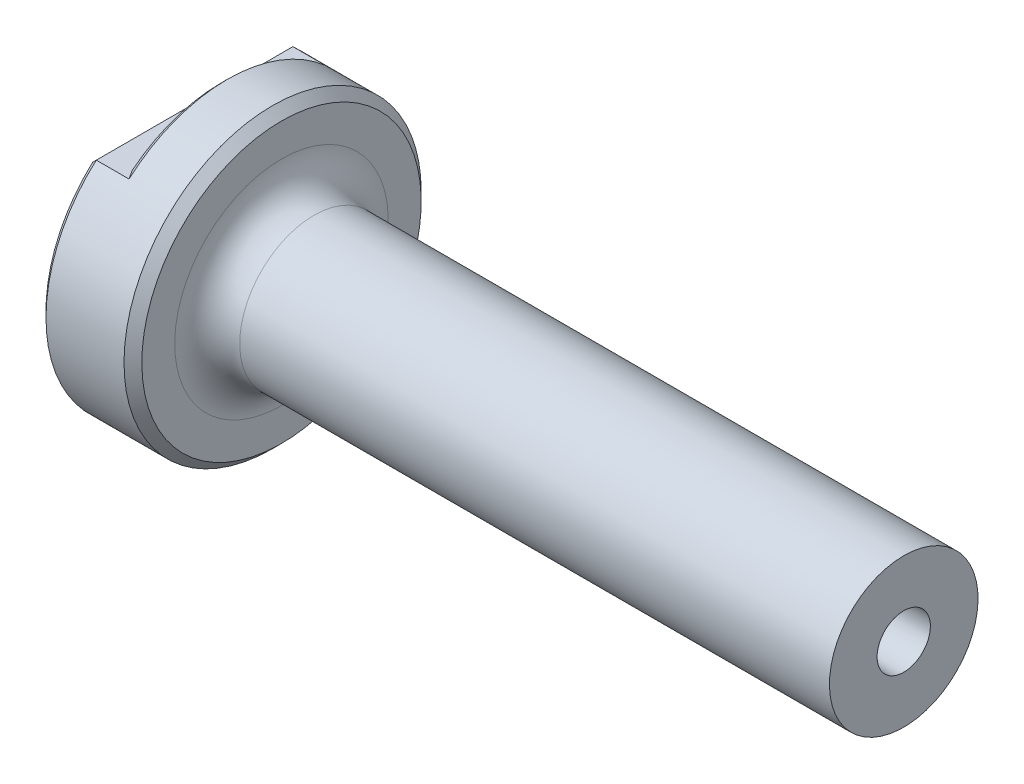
ISO-10303-21;
HEADER;
FILE_DESCRIPTION(('STEP AP214'),'2;1');
FILE_NAME('part.step','',(''),(''),'','','');
FILE_SCHEMA(('AUTOMOTIVE_DESIGN { 1 0 10303 214 1 1 1 1 }'));
ENDSEC;
DATA;
#1=APPLICATION_CONTEXT('core data for automotive mechanical design processes');
#2=APPLICATION_PROTOCOL_DEFINITION('international standard','automotive_design',2000,#1);
#3=PRODUCT_CONTEXT('',#1,'mechanical');
#4=PRODUCT('Part','Part','',(#3));
#5=PRODUCT_RELATED_PRODUCT_CATEGORY('part','',(#4));
#6=PRODUCT_DEFINITION_FORMATION('','',#4);
#7=PRODUCT_DEFINITION_CONTEXT('part definition',#1,'design');
#8=PRODUCT_DEFINITION('design','',#6,#7);
#9=PRODUCT_DEFINITION_SHAPE('','',#8);
#10=(LENGTH_UNIT() NAMED_UNIT(*) SI_UNIT(.MILLI.,.METRE.));
#11=(NAMED_UNIT(*) PLANE_ANGLE_UNIT() SI_UNIT($,.RADIAN.));
#12=(NAMED_UNIT(*) SI_UNIT($,.STERADIAN.) SOLID_ANGLE_UNIT());
#13=UNCERTAINTY_MEASURE_WITH_UNIT(LENGTH_MEASURE(1.E-05),#10,'distance_accuracy_value','');
#14=(GEOMETRIC_REPRESENTATION_CONTEXT(3) GLOBAL_UNCERTAINTY_ASSIGNED_CONTEXT((#13)) GLOBAL_UNIT_ASSIGNED_CONTEXT((#10,
#11,#12)) REPRESENTATION_CONTEXT('',''));
#15=CARTESIAN_POINT('',(0.,0.,0.));
#16=DIRECTION('',(0.,0.,1.));
#17=DIRECTION('',(1.,0.,0.));
#18=AXIS2_PLACEMENT_3D('',#15,#16,#17);
#19=CARTESIAN_POINT('',(61.11875,0.,0.));
#20=DIRECTION('',(1.,0.,0.));
#21=DIRECTION('',(0.,0.,-1.));
#22=AXIS2_PLACEMENT_3D('',#19,#20,#21);
#23=PLANE('',#22);
#24=CARTESIAN_POINT('',(61.11875,0.,0.));
#25=DIRECTION('',(1.,0.,0.));
#26=DIRECTION('',(0.,1.,0.));
#27=AXIS2_PLACEMENT_3D('',#24,#25,#26);
#28=CIRCLE('',#27,12.7);
#29=CARTESIAN_POINT('',(61.11875,12.7,0.));
#30=VERTEX_POINT('',#29);
#31=EDGE_CURVE('E101',#30,#30,#28,.T.);
#32=ORIENTED_EDGE('',*,*,#31,.T.);
#33=EDGE_LOOP('',(#32));
#34=FACE_BOUND('',#33,.T.);
#35=CARTESIAN_POINT('',(61.11875,0.,0.));
#36=DIRECTION('',(1.,0.,0.));
#37=DIRECTION('',(0.,1.,0.));
#38=AXIS2_PLACEMENT_3D('',#35,#36,#37);
#39=CIRCLE('',#38,4.55414053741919);
#40=CARTESIAN_POINT('',(61.11875,4.55414053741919,0.));
#41=VERTEX_POINT('',#40);
#42=EDGE_CURVE('E157',#41,#41,#39,.T.);
#43=ORIENTED_EDGE('',*,*,#42,.F.);
#44=EDGE_LOOP('',(#43));
#45=FACE_BOUND('',#44,.T.);
#46=ADVANCED_FACE('F32',(#34,#45),#23,.T.);
#47=CARTESIAN_POINT('',(-61.11875,0.,0.));
#48=DIRECTION('',(1.,0.,0.));
#49=DIRECTION('',(0.,0.,-1.));
#50=AXIS2_PLACEMENT_3D('',#47,#48,#49);
#51=PLANE('',#50);
#52=CARTESIAN_POINT('',(-61.11875,0.,0.));
#53=DIRECTION('',(1.,0.,0.));
#54=DIRECTION('',(0.,0.,-1.));
#55=AXIS2_PLACEMENT_3D('',#52,#53,#54);
#56=CIRCLE('',#55,24.384);
#57=CARTESIAN_POINT('',(-61.11875,18.034,-16.4120169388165));
#58=VERTEX_POINT('',#57);
#59=CARTESIAN_POINT('',(-61.11875,18.034,16.4120169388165));
#60=VERTEX_POINT('',#59);
#61=EDGE_CURVE('E52',#58,#60,#56,.F.);
#62=ORIENTED_EDGE('',*,*,#61,.T.);
#63=DIRECTION('',(0.,0.,-1.));
#64=VECTOR('',#63,1.);
#65=CARTESIAN_POINT('',(-61.11875,18.034,0.));
#66=LINE('',#65,#64);
#67=EDGE_CURVE('E126',#60,#58,#66,.T.);
#68=ORIENTED_EDGE('',*,*,#67,.T.);
#69=EDGE_LOOP('',(#62,#68));
#70=FACE_BOUND('',#69,.T.);
#71=CARTESIAN_POINT('',(-61.11875,0.,0.));
#72=DIRECTION('',(1.,0.,0.));
#73=DIRECTION('',(0.,1.,0.));
#74=AXIS2_PLACEMENT_3D('',#71,#72,#73);
#75=CIRCLE('',#74,9.80045101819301);
#76=CARTESIAN_POINT('',(-61.11875,9.800451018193,0.));
#77=VERTEX_POINT('',#76);
#78=EDGE_CURVE('E106',#77,#77,#75,.T.);
#79=ORIENTED_EDGE('',*,*,#78,.T.);
#80=EDGE_LOOP('',(#79));
#81=FACE_BOUND('',#80,.T.);
#82=ADVANCED_FACE('F166',(#70,#81),#51,.F.);
#83=CARTESIAN_POINT('',(61.11875,0.,0.));
#84=DIRECTION('',(-1.,0.,0.));
#85=DIRECTION('',(0.,0.,1.));
#86=AXIS2_PLACEMENT_3D('',#83,#84,#85);
#87=CYLINDRICAL_SURFACE('',#86,25.4);
#88=CARTESIAN_POINT('',(-46.76775,0.,0.));
#89=DIRECTION('',(1.,0.,0.));
#90=DIRECTION('',(0.,0.,-1.));
#91=AXIS2_PLACEMENT_3D('',#88,#89,#90);
#92=CIRCLE('',#91,25.4);
#93=CARTESIAN_POINT('',(-46.76775,0.,-25.4));
#94=VERTEX_POINT('',#93);
#95=EDGE_CURVE('E97',#94,#94,#92,.F.);
#96=ORIENTED_EDGE('',*,*,#95,.T.);
#97=EDGE_LOOP('',(#96));
#98=FACE_BOUND('',#97,.T.);
#99=DIRECTION('',(-1.,0.,0.));
#100=VECTOR('',#99,1.);
#101=CARTESIAN_POINT('',(61.11875,19.05,-16.8005208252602));
#102=LINE('',#101,#100);
#103=CARTESIAN_POINT('',(-60.10275,19.05,-16.8005208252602));
#104=VERTEX_POINT('',#103);
#105=CARTESIAN_POINT('',(-54.5147499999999,19.05,-16.8005208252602));
#106=VERTEX_POINT('',#105);
#107=EDGE_CURVE('E100',#104,#106,#102,.F.);
#108=ORIENTED_EDGE('',*,*,#107,.T.);
#109=CARTESIAN_POINT('',(-54.5147499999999,0.,0.));
#110=DIRECTION('',(-1.,0.,0.));
#111=DIRECTION('',(0.,0.,1.));
#112=AXIS2_PLACEMENT_3D('',#109,#110,#111);
#113=CIRCLE('',#112,25.4);
#114=CARTESIAN_POINT('',(-54.5147499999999,19.05,16.8005208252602));
#115=VERTEX_POINT('',#114);
#116=EDGE_CURVE('E86',#106,#115,#113,.F.);
#117=ORIENTED_EDGE('',*,*,#116,.T.);
#118=DIRECTION('',(-1.,0.,0.));
#119=VECTOR('',#118,1.);
#120=CARTESIAN_POINT('',(61.11875,19.05,16.8005208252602));
#121=LINE('',#120,#119);
#122=CARTESIAN_POINT('',(-60.10275,19.05,16.8005208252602));
#123=VERTEX_POINT('',#122);
#124=EDGE_CURVE('E103',#115,#123,#121,.T.);
#125=ORIENTED_EDGE('',*,*,#124,.T.);
#126=CARTESIAN_POINT('',(-60.10275,0.,0.));
#127=DIRECTION('',(1.,0.,0.));
#128=DIRECTION('',(0.,0.,-1.));
#129=AXIS2_PLACEMENT_3D('',#126,#127,#128);
#130=CIRCLE('',#129,25.4);
#131=EDGE_CURVE('E96',#123,#104,#130,.T.);
#132=ORIENTED_EDGE('',*,*,#131,.T.);
#133=EDGE_LOOP('',(#108,#117,#125,#132));
#134=FACE_BOUND('',#133,.T.);
#135=ADVANCED_FACE('F188',(#98,#134),#87,.T.);
#136=CARTESIAN_POINT('',(-55.53075,0.,0.));
#137=DIRECTION('',(-1.,0.,0.));
#138=DIRECTION('',(0.,0.,1.));
#139=AXIS2_PLACEMENT_3D('',#136,#137,#138);
#140=PLANE('',#139);
#141=DIRECTION('',(0.,0.,1.));
#142=VECTOR('',#141,1.);
#143=CARTESIAN_POINT('',(-55.53075,19.05,-25.4));
#144=LINE('',#143,#142);
#145=CARTESIAN_POINT('',(-55.53075,19.05,-15.2209380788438));
#146=VERTEX_POINT('',#145);
#147=CARTESIAN_POINT('',(-55.53075,19.05,15.2209380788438));
#148=VERTEX_POINT('',#147);
#149=EDGE_CURVE('E95',#146,#148,#144,.T.);
#150=ORIENTED_EDGE('',*,*,#149,.T.);
#151=CARTESIAN_POINT('',(-55.53075,0.,0.));
#152=DIRECTION('',(-1.,0.,0.));
#153=DIRECTION('',(0.,0.,1.));
#154=AXIS2_PLACEMENT_3D('',#151,#152,#153);
#155=CIRCLE('',#154,24.384);
#156=EDGE_CURVE('E84',#148,#146,#155,.T.);
#157=ORIENTED_EDGE('',*,*,#156,.T.);
#158=EDGE_LOOP('',(#150,#157));
#159=FACE_BOUND('',#158,.T.);
#160=ADVANCED_FACE('F94',(#159),#140,.T.);
#161=CARTESIAN_POINT('',(-55.53075,19.05,-25.4));
#162=DIRECTION('',(0.,-1.,0.));
#163=DIRECTION('',(0.,0.,-1.));
#164=AXIS2_PLACEMENT_3D('',#161,#162,#163);
#165=PLANE('',#164);
#166=ORIENTED_EDGE('',*,*,#107,.F.);
#167=DIRECTION('',(0.,0.,1.));
#168=VECTOR('',#167,1.);
#169=CARTESIAN_POINT('',(-60.10275,19.05,-25.4));
#170=LINE('',#169,#168);
#171=EDGE_CURVE('E90',#104,#123,#170,.T.);
#172=ORIENTED_EDGE('',*,*,#171,.T.);
#173=ORIENTED_EDGE('',*,*,#124,.F.);
#174=CARTESIAN_POINT('',(-54.5147499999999,19.05,16.8005208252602));
#175=CARTESIAN_POINT('',(-54.6010969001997,19.05,16.6699759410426));
#176=CARTESIAN_POINT('',(-54.6870507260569,19.05,16.5391707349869));
#177=CARTESIAN_POINT('',(-54.8581291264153,19.05,16.2770272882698));
#178=CARTESIAN_POINT('',(-54.9432537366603,19.05,16.1456890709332));
#179=CARTESIAN_POINT('',(-55.1126383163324,19.05,15.8824555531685));
#180=CARTESIAN_POINT('',(-55.1968982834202,19.05,15.7505602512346));
#181=CARTESIAN_POINT('',(-55.3645140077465,19.05,15.486188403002));
#182=CARTESIAN_POINT('',(-55.4478697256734,19.05,15.3537118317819));
#183=CARTESIAN_POINT('',(-55.53075,19.05,15.2209380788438));
#184=B_SPLINE_CURVE_WITH_KNOTS('',3,(#174,#175,#176,#177,#178,#179,#180,#181,#182,#183),
.UNSPECIFIED.,.F.,.F.,(4,2,2,2,4),(0.,0.469552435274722,0.939084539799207,1.40861791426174,
1.87817162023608),.UNSPECIFIED.);
#185=EDGE_CURVE('E11',#115,#148,#184,.T.);
#186=ORIENTED_EDGE('',*,*,#185,.T.);
#187=ORIENTED_EDGE('',*,*,#149,.F.);
#188=CARTESIAN_POINT('',(-55.53075,19.05,-15.2209380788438));
#189=CARTESIAN_POINT('',(-55.4478697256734,19.05,-15.3537118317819));
#190=CARTESIAN_POINT('',(-55.3645140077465,19.05,-15.486188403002));
#191=CARTESIAN_POINT('',(-55.1968982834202,19.05,-15.7505602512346));
#192=CARTESIAN_POINT('',(-55.1126383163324,19.05,-15.8824555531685));
#193=CARTESIAN_POINT('',(-54.9432537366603,19.05,-16.1456890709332));
#194=CARTESIAN_POINT('',(-54.8581291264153,19.05,-16.2770272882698));
#195=CARTESIAN_POINT('',(-54.687050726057,19.05,-16.5391707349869));
#196=CARTESIAN_POINT('',(-54.6010969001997,19.05,-16.6699759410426));
#197=CARTESIAN_POINT('',(-54.5147499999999,19.05,-16.8005208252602));
#198=B_SPLINE_CURVE_WITH_KNOTS('',3,(#188,#189,#190,#191,#192,#193,#194,#195,#196,#197),
.UNSPECIFIED.,.F.,.F.,(4,2,2,2,4),(0.,0.469553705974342,0.939087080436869,1.40861918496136,
1.87817162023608),.UNSPECIFIED.);
#199=EDGE_CURVE('E45',#146,#106,#198,.T.);
#200=ORIENTED_EDGE('',*,*,#199,.T.);
#201=EDGE_LOOP('',(#166,#172,#173,#186,#187,#200));
#202=FACE_BOUND('',#201,.T.);
#203=ADVANCED_FACE('F99',(#202),#165,.F.);
#204=CARTESIAN_POINT('',(-45.24375,-25.4,0.));
#205=DIRECTION('',(1.,0.,0.));
#206=DIRECTION('',(0.,1.,0.));
#207=AXIS2_PLACEMENT_3D('',#204,#205,#206);
#208=PLANE('',#207);
#209=CARTESIAN_POINT('',(-45.24375,0.,0.));
#210=DIRECTION('',(1.,0.,0.));
#211=DIRECTION('',(0.,1.,0.));
#212=AXIS2_PLACEMENT_3D('',#209,#210,#211);
#213=CIRCLE('',#212,23.876);
#214=CARTESIAN_POINT('',(-45.24375,23.876,0.));
#215=VERTEX_POINT('',#214);
#216=EDGE_CURVE('E118',#215,#215,#213,.T.);
#217=ORIENTED_EDGE('',*,*,#216,.T.);
#218=EDGE_LOOP('',(#217));
#219=FACE_BOUND('',#218,.T.);
#220=CARTESIAN_POINT('',(-45.24375,0.,0.));
#221=DIRECTION('',(1.,0.,0.));
#222=DIRECTION('',(0.,1.,0.));
#223=AXIS2_PLACEMENT_3D('',#220,#221,#222);
#224=CIRCLE('',#223,18.25625);
#225=CARTESIAN_POINT('',(-45.24375,18.25625,0.));
#226=VERTEX_POINT('',#225);
#227=EDGE_CURVE('E115',#226,#226,#224,.F.);
#228=ORIENTED_EDGE('',*,*,#227,.T.);
#229=EDGE_LOOP('',(#228));
#230=FACE_BOUND('',#229,.T.);
#231=ADVANCED_FACE('F180',(#219,#230),#208,.T.);
#232=CARTESIAN_POINT('',(61.11875,0.,0.));
#233=DIRECTION('',(1.,0.,0.));
#234=DIRECTION('',(0.,1.,0.));
#235=AXIS2_PLACEMENT_3D('',#232,#233,#234);
#236=CYLINDRICAL_SURFACE('',#235,12.7);
#237=CARTESIAN_POINT('',(-39.6875,0.,0.));
#238=DIRECTION('',(1.,0.,0.));
#239=DIRECTION('',(0.,1.,0.));
#240=AXIS2_PLACEMENT_3D('',#237,#238,#239);
#241=CIRCLE('',#240,12.7);
#242=CARTESIAN_POINT('',(-39.6875,12.7,0.));
#243=VERTEX_POINT('',#242);
#244=EDGE_CURVE('E112',#243,#243,#241,.T.);
#245=ORIENTED_EDGE('',*,*,#244,.T.);
#246=EDGE_LOOP('',(#245));
#247=FACE_BOUND('',#246,.T.);
#248=ORIENTED_EDGE('',*,*,#31,.F.);
#249=EDGE_LOOP('',(#248));
#250=FACE_BOUND('',#249,.T.);
#251=ADVANCED_FACE('F171',(#247,#250),#236,.T.);
#252=CARTESIAN_POINT('',(-69.19595,0.,0.));
#253=DIRECTION('',(1.,0.,0.));
#254=DIRECTION('',(0.,1.,0.));
#255=AXIS2_PLACEMENT_3D('',#252,#253,#254);
#256=SPHERICAL_SURFACE('',#255,12.7);
#257=CARTESIAN_POINT('',(-56.6519372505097,0.,0.));
#258=DIRECTION('',(1.,0.,0.));
#259=DIRECTION('',(0.,1.,0.));
#260=AXIS2_PLACEMENT_3D('',#257,#258,#259);
#261=CIRCLE('',#260,1.984375);
#262=CARTESIAN_POINT('',(-56.6519372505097,1.98437500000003,0.));
#263=VERTEX_POINT('',#262);
#264=EDGE_CURVE('E154',#263,#263,#261,.T.);
#265=CARTESIAN_POINT('',(-56.6519372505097,1.98437500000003,0.));
#266=CARTESIAN_POINT('',(-56.6669149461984,2.07905616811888,0.));
#267=CARTESIAN_POINT('',(-56.682964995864,2.1735676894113,0.));
#268=CARTESIAN_POINT('',(-56.7172007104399,2.36220313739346,0.));
#269=CARTESIAN_POINT('',(-56.7353863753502,2.45632706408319,0.));
#270=CARTESIAN_POINT('',(-56.7738842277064,2.6441390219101,0.));
#271=CARTESIAN_POINT('',(-56.7941964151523,2.73782705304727,0.));
#272=CARTESIAN_POINT('',(-56.8369368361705,2.92471919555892,0.));
#273=CARTESIAN_POINT('',(-56.8593650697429,3.0179233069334,0.));
#274=CARTESIAN_POINT('',(-56.9063261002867,3.20379981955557,0.));
#275=CARTESIAN_POINT('',(-56.9308588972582,3.29647222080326,0.));
#276=CARTESIAN_POINT('',(-56.9820164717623,3.48123779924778,0.));
#277=CARTESIAN_POINT('',(-57.008641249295,3.57333097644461,0.));
#278=CARTESIAN_POINT('',(-57.0639691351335,3.75689088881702,0.));
#279=CARTESIAN_POINT('',(-57.0926722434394,3.84835762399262,0.));
#280=CARTESIAN_POINT('',(-57.152142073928,4.03061775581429,0.));
#281=CARTESIAN_POINT('',(-57.1829087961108,4.12141115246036,0.));
#282=CARTESIAN_POINT('',(-57.2464900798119,4.30227805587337,0.));
#283=CARTESIAN_POINT('',(-57.2793046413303,4.39235156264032,0.));
#284=CARTESIAN_POINT('',(-57.3469647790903,4.57173250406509,0.));
#285=CARTESIAN_POINT('',(-57.3818103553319,4.66103993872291,0.));
#286=CARTESIAN_POINT('',(-57.4535146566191,4.83884294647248,0.));
#287=CARTESIAN_POINT('',(-57.4903733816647,4.92733851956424,0.));
#288=CARTESIAN_POINT('',(-57.5660850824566,5.10347243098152,0.));
#289=CARTESIAN_POINT('',(-57.604938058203,5.19111076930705,0.));
#290=CARTESIAN_POINT('',(-57.6846183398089,5.36548527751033,0.));
#291=CARTESIAN_POINT('',(-57.7254456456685,5.45222144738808,0.));
#292=CARTESIAN_POINT('',(-57.8090536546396,5.62474714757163,0.));
#293=CARTESIAN_POINT('',(-57.8518343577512,5.71053667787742,0.));
#294=CARTESIAN_POINT('',(-57.9393272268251,5.8811251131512,0.));
#295=CARTESIAN_POINT('',(-57.9840393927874,5.96592401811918,0.));
#296=CARTESIAN_POINT('',(-58.0753722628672,6.13448772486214,0.));
#297=CARTESIAN_POINT('',(-58.1219929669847,6.21825252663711,0.));
#298=CARTESIAN_POINT('',(-58.2171190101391,6.38470507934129,0.));
#299=CARTESIAN_POINT('',(-58.2656243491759,6.4673928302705,0.));
#300=CARTESIAN_POINT('',(-58.3644947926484,6.63164888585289,0.));
#301=CARTESIAN_POINT('',(-58.4148598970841,6.71321719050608,0.));
#302=CARTESIAN_POINT('',(-58.5174240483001,6.87519253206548,0.));
#303=CARTESIAN_POINT('',(-58.5696230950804,6.95559956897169,0.));
#304=CARTESIAN_POINT('',(-58.6758283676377,7.11521114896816,0.));
#305=CARTESIAN_POINT('',(-58.7298345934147,7.19441569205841,0.));
#306=CARTESIAN_POINT('',(-58.8396265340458,7.35158167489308,0.));
#307=CARTESIAN_POINT('',(-58.8954122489,7.4295431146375,0.));
#308=CARTESIAN_POINT('',(-59.0087345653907,7.58418291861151,0.));
#309=CARTESIAN_POINT('',(-59.0662711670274,7.6608612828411,0.));
#310=CARTESIAN_POINT('',(-59.1830657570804,7.81289562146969,0.));
#311=CARTESIAN_POINT('',(-59.2423237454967,7.88825159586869,0.));
#312=CARTESIAN_POINT('',(-59.3625307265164,8.03760251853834,0.));
#313=CARTESIAN_POINT('',(-59.4234797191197,8.11159746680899,0.));
#314=CARTESIAN_POINT('',(-59.5470374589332,8.25818839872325,0.));
#315=CARTESIAN_POINT('',(-59.6096462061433,8.33078438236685,0.));
#316=CARTESIAN_POINT('',(-59.7364913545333,8.47454016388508,0.));
#317=CARTESIAN_POINT('',(-59.8007277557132,8.54569996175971,0.));
#318=CARTESIAN_POINT('',(-59.9307952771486,8.68654688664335,0.));
#319=CARTESIAN_POINT('',(-59.9966263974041,8.75623401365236,0.));
#320=CARTESIAN_POINT('',(-60.1298496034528,8.89409986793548,0.));
#321=CARTESIAN_POINT('',(-60.1972416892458,8.9622785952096,0.));
#322=CARTESIAN_POINT('',(-60.3335522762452,9.09709269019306,0.));
#323=CARTESIAN_POINT('',(-60.4024707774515,9.16372805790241,0.));
#324=CARTESIAN_POINT('',(-60.5417988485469,9.29542128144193,0.));
#325=CARTESIAN_POINT('',(-60.6122084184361,9.36047913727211,0.));
#326=CARTESIAN_POINT('',(-60.7544825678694,9.4889839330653,0.));
#327=CARTESIAN_POINT('',(-60.8263471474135,9.55243087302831,0.));
#328=CARTESIAN_POINT('',(-60.9714943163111,9.67768148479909,0.));
#329=CARTESIAN_POINT('',(-61.0447769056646,9.73948515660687,0.));
#330=CARTESIAN_POINT('',(-61.11875,9.800451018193,0.));
#331=B_SPLINE_CURVE_WITH_KNOTS('',3,(#265,#266,#267,#268,#269,#270,#271,#272,#273,#274,#275,
#276,#277,#278,#279,#280,#281,#282,#283,#284,#285,#286,#287,#288,#289,#290,#291,#292,#293,#294,
#295,#296,#297,#298,#299,#300,#301,#302,#303,#304,#305,#306,#307,#308,#309,#310,#311,#312,#313,
#314,#315,#316,#317,#318,#319,#320,#321,#322,#323,#324,#325,#326,#327,#328,#329,#330),
.UNSPECIFIED.,.F.,.F.,(4,2,2,2,2,2,2,2,2,2,2,2,2,2,2,2,2,2,2,2,2,2,2,2,2,2,2,2,2,2,2,2,4),(0.,
0.287569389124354,0.575138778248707,0.862708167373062,1.15027755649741,1.43784694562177,
1.72541633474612,2.01298572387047,2.30055511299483,2.58812450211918,2.87569389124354,
3.16326328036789,3.45083266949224,3.73840205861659,4.02597144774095,4.3135408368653,
4.60111022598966,4.88867961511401,5.17624900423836,5.46381839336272,5.75138778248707,
6.03895717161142,6.32652656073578,6.61409594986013,6.90166533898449,7.18923472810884,
7.47680411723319,7.76437350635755,8.0519428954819,8.33951228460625,8.62708167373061,
8.91465106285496,9.20222045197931),.UNSPECIFIED.);
#332=EDGE_CURVE('BSEAM168',#263,#77,#331,.T.);
#333=ORIENTED_EDGE('',*,*,#264,.T.);
#334=ORIENTED_EDGE('',*,*,#78,.F.);
#335=ORIENTED_EDGE('',*,*,#332,.T.);
#336=ORIENTED_EDGE('',*,*,#332,.F.);
#337=EDGE_LOOP('',(#333,#335,#334,#336));
#338=FACE_BOUND('',#337,.T.);
#339=ADVANCED_FACE('F168',(#338),#256,.F.);
#340=CARTESIAN_POINT('',(-56.6519372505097,0.,0.));
#341=DIRECTION('',(1.,0.,0.));
#342=DIRECTION('',(0.,1.,0.));
#343=AXIS2_PLACEMENT_3D('',#340,#341,#342);
#344=CONICAL_SURFACE('',#343,1.984375,0.0218166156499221);
#345=ORIENTED_EDGE('',*,*,#42,.T.);
#346=EDGE_LOOP('',(#345));
#347=FACE_BOUND('',#346,.T.);
#348=ORIENTED_EDGE('',*,*,#264,.F.);
#349=EDGE_LOOP('',(#348));
#350=FACE_BOUND('',#349,.T.);
#351=ADVANCED_FACE('F170',(#347,#350),#344,.F.);
#352=CARTESIAN_POINT('',(-39.6875,0.,0.));
#353=DIRECTION('',(1.,0.,0.));
#354=DIRECTION('',(0.,1.,0.));
#355=AXIS2_PLACEMENT_3D('',#352,#353,#354);
#356=TOROIDAL_SURFACE('',#355,18.25625,5.55625);
#357=ORIENTED_EDGE('',*,*,#227,.F.);
#358=EDGE_LOOP('',(#357));
#359=FACE_BOUND('',#358,.T.);
#360=ORIENTED_EDGE('',*,*,#244,.F.);
#361=EDGE_LOOP('',(#360));
#362=FACE_BOUND('',#361,.T.);
#363=ADVANCED_FACE('F177',(#359,#362),#356,.F.);
#364=CARTESIAN_POINT('',(-45.24375,0.,0.));
#365=DIRECTION('',(-1.,0.,0.));
#366=DIRECTION('',(0.,0.,1.));
#367=AXIS2_PLACEMENT_3D('',#364,#365,#366);
#368=CONICAL_SURFACE('',#367,23.876,0.785398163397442);
#369=ORIENTED_EDGE('',*,*,#95,.F.);
#370=EDGE_LOOP('',(#369));
#371=FACE_BOUND('',#370,.T.);
#372=ORIENTED_EDGE('',*,*,#216,.F.);
#373=EDGE_LOOP('',(#372));
#374=FACE_BOUND('',#373,.T.);
#375=ADVANCED_FACE('F144',(#371,#374),#368,.T.);
#376=CARTESIAN_POINT('',(-55.53075,0.,0.));
#377=DIRECTION('',(1.,0.,0.));
#378=DIRECTION('',(0.,0.,-1.));
#379=AXIS2_PLACEMENT_3D('',#376,#377,#378);
#380=CONICAL_SURFACE('',#379,24.384,0.785398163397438);
#381=ORIENTED_EDGE('',*,*,#185,.F.);
#382=ORIENTED_EDGE('',*,*,#116,.F.);
#383=ORIENTED_EDGE('',*,*,#199,.F.);
#384=ORIENTED_EDGE('',*,*,#156,.F.);
#385=EDGE_LOOP('',(#381,#382,#383,#384));
#386=FACE_BOUND('',#385,.T.);
#387=ADVANCED_FACE('F83',(#386),#380,.T.);
#388=CARTESIAN_POINT('',(-60.10275,0.,0.));
#389=DIRECTION('',(1.,0.,0.));
#390=DIRECTION('',(0.,0.,-1.));
#391=AXIS2_PLACEMENT_3D('',#388,#389,#390);
#392=CONICAL_SURFACE('',#391,25.4,0.78539816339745);
#393=CARTESIAN_POINT('',(-61.11875,18.034,-16.4120169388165));
#394=CARTESIAN_POINT('',(-60.949551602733,18.203198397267,-16.4774733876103));
#395=CARTESIAN_POINT('',(-60.7802857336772,18.3724642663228,-16.5425769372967));
#396=CARTESIAN_POINT('',(-60.4416190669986,18.7111309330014,-16.6720782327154));
#397=CARTESIAN_POINT('',(-60.2722182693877,18.8805317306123,-16.7364759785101));
#398=CARTESIAN_POINT('',(-60.10275,19.05,-16.8005208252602));
#399=B_SPLINE_CURVE_WITH_KNOTS('',3,(#393,#394,#395,#396,#397,#398),.UNSPECIFIED.,.F.,.F.,(4,2,
4),(0.,0.744219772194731,1.48843947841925),.UNSPECIFIED.);
#400=EDGE_CURVE('E60',#104,#58,#399,.F.);
#401=ORIENTED_EDGE('',*,*,#400,.F.);
#402=ORIENTED_EDGE('',*,*,#131,.F.);
#403=CARTESIAN_POINT('',(-60.10275,19.05,16.8005208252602));
#404=CARTESIAN_POINT('',(-60.2722182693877,18.8805317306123,16.7364759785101));
#405=CARTESIAN_POINT('',(-60.4416190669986,18.7111309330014,16.6720782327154));
#406=CARTESIAN_POINT('',(-60.7802857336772,18.3724642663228,16.5425769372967));
#407=CARTESIAN_POINT('',(-60.949551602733,18.203198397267,16.4774733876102));
#408=CARTESIAN_POINT('',(-61.11875,18.034,16.4120169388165));
#409=B_SPLINE_CURVE_WITH_KNOTS('',3,(#403,#404,#405,#406,#407,#408),.UNSPECIFIED.,.F.,.F.,(4,2,
4),(0.,0.744219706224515,1.48843947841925),.UNSPECIFIED.);
#410=EDGE_CURVE('E37',#60,#123,#409,.F.);
#411=ORIENTED_EDGE('',*,*,#410,.F.);
#412=ORIENTED_EDGE('',*,*,#61,.F.);
#413=EDGE_LOOP('',(#401,#402,#411,#412));
#414=FACE_BOUND('',#413,.T.);
#415=ADVANCED_FACE('F143',(#414),#392,.T.);
#416=CARTESIAN_POINT('',(-61.11875,18.034,0.));
#417=DIRECTION('',(0.707106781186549,-0.707106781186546,0.));
#418=DIRECTION('',(0.,0.,-1.));
#419=AXIS2_PLACEMENT_3D('',#416,#417,#418);
#420=PLANE('',#419);
#421=ORIENTED_EDGE('',*,*,#410,.T.);
#422=ORIENTED_EDGE('',*,*,#171,.F.);
#423=ORIENTED_EDGE('',*,*,#400,.T.);
#424=ORIENTED_EDGE('',*,*,#67,.F.);
#425=EDGE_LOOP('',(#421,#422,#423,#424));
#426=FACE_BOUND('',#425,.T.);
#427=ADVANCED_FACE('F34',(#426),#420,.F.);
#428=CLOSED_SHELL('',(#46,#82,#135,#160,#203,#231,#251,#339,#351,#363,#375,#387,#415,#427));
#429=MANIFOLD_SOLID_BREP('B2',#428);
#430=ADVANCED_BREP_SHAPE_REPRESENTATION('',(#18,#429),#14);
#431=SHAPE_DEFINITION_REPRESENTATION(#9,#430);
ENDSEC;
END-ISO-10303-21;
